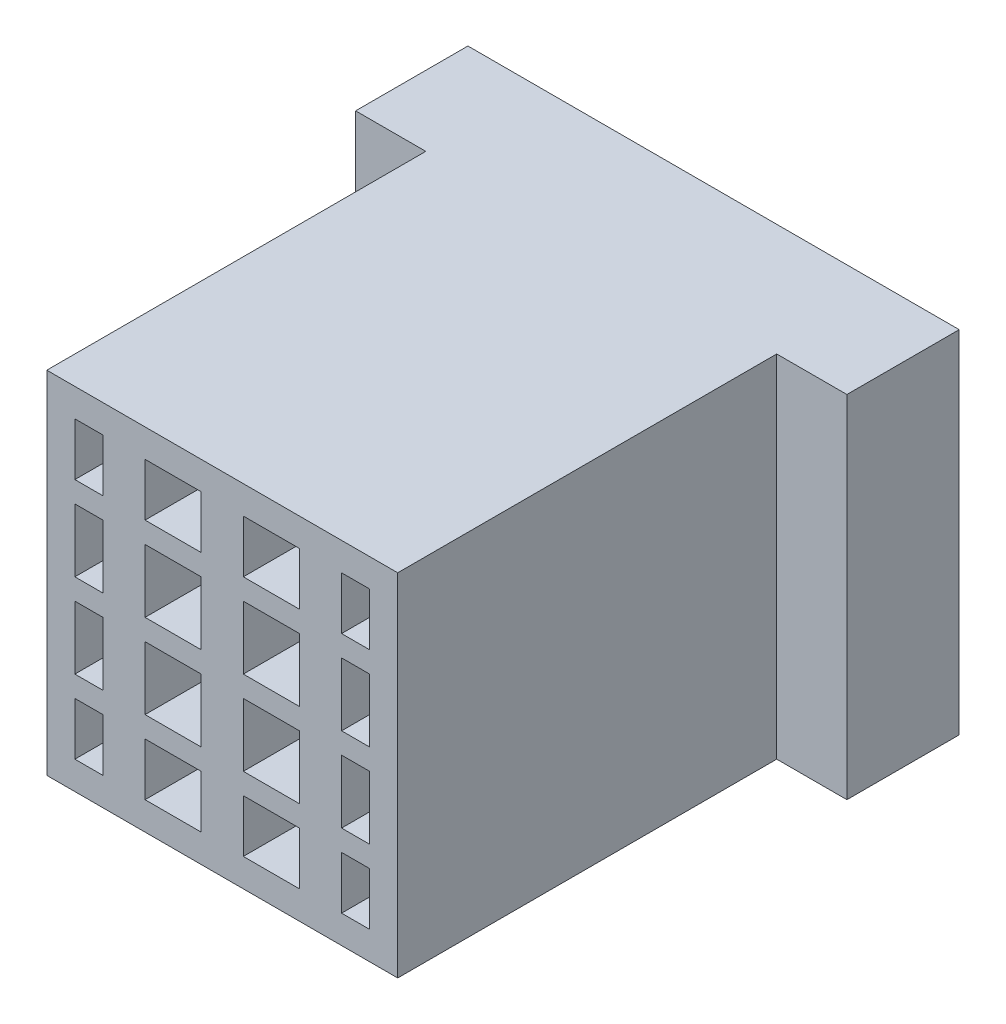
from build123d import *

# Parameters (mm, degrees)
SKETCH_8_W          = 25
SKETCH_8_H          = 25
SKETCH_8_W_2        = 4
SKETCH_8_H_2        = 21
SKETCH_8_W_3        = 2
EXTRUDE_7_DEPTH     = 25
SKETCH_9_W          = 25
SKETCH_9_H          = 25
EXTRUDE_8_DEPTH     = 2
SKETCH_11_W         = 35
SKETCH_11_H         = 25
EXTRUDE_9_DEPTH     = 6
SKETCH_12_W         = 30
SKETCH_12_H         = 21
CUT_EXTRUDE_1_DEPTH = 4
SKETCH_14_W         = 25
SKETCH_14_H         = 1.5
EXTRUDE_11_DEPTH    = 25
SKETCH_15_W         = 35
SKETCH_15_H         = 25
EXTRUDE_12_DEPTH    = 2


with BuildPart() as part:
    # Sketch 8 → Extrude 7 (new body)
    with BuildSketch(Plane.XY):
        Rectangle(SKETCH_8_W, SKETCH_8_H)
        with Locations((3.5, 0)):
            Rectangle(SKETCH_8_W_2, SKETCH_8_H_2, mode=Mode.SUBTRACT)
        with Locations((-3.5, 0)):
            Rectangle(SKETCH_8_W_2, SKETCH_8_H_2, mode=Mode.SUBTRACT)
        with Locations((-9.5, 0)):
            Rectangle(SKETCH_8_W_3, SKETCH_8_H_2, mode=Mode.SUBTRACT)
        with Locations((9.5, 0)):
            Rectangle(SKETCH_8_W_3, SKETCH_8_H_2, mode=Mode.SUBTRACT)
    extrude(amount=EXTRUDE_7_DEPTH)

    # Sketch 9 → Extrude 8 (add)
    with BuildSketch(Plane(origin=(0, 0, 0), x_dir=(-1, 0, 0), z_dir=(0, 0, -1))):
        Rectangle(SKETCH_9_W, SKETCH_9_H)
    extrude(amount=EXTRUDE_8_DEPTH)

    # Sketch 11 → Extrude 9 (add)
    with BuildSketch(Plane(origin=(0, 0, -2), x_dir=(-1, 0, 0), z_dir=(0, 0, -1))):
        Rectangle(SKETCH_11_W, SKETCH_11_H)
    extrude(amount=EXTRUDE_9_DEPTH)

    # Sketch 12 → Cut-Extrude 1 (cut)
    with BuildSketch(Plane(origin=(0, 0, -8), x_dir=(-1, 0, 0), z_dir=(0, 0, -1))):
        Rectangle(SKETCH_12_W, SKETCH_12_H)
    extrude(amount=-CUT_EXTRUDE_1_DEPTH, mode=Mode.SUBTRACT)

    # Sketch 14 → Extrude 11 (add)
    with BuildSketch(Plane.XY.offset(25)):
        Rectangle(SKETCH_14_W, SKETCH_14_H)
        with Locations((0, 6)):
            Rectangle(SKETCH_14_W, SKETCH_14_H)
        with Locations((0, -6)):
            Rectangle(SKETCH_14_W, SKETCH_14_H)
    extrude(amount=-EXTRUDE_11_DEPTH)

    # Sketch 15 → Extrude 12 (add)
    with BuildSketch(Plane(origin=(0, 0, -8), x_dir=(-1, 0, 0), z_dir=(0, 0, -1))):
        Rectangle(SKETCH_15_W, SKETCH_15_H)
    extrude(amount=EXTRUDE_12_DEPTH)


solid = part.part
